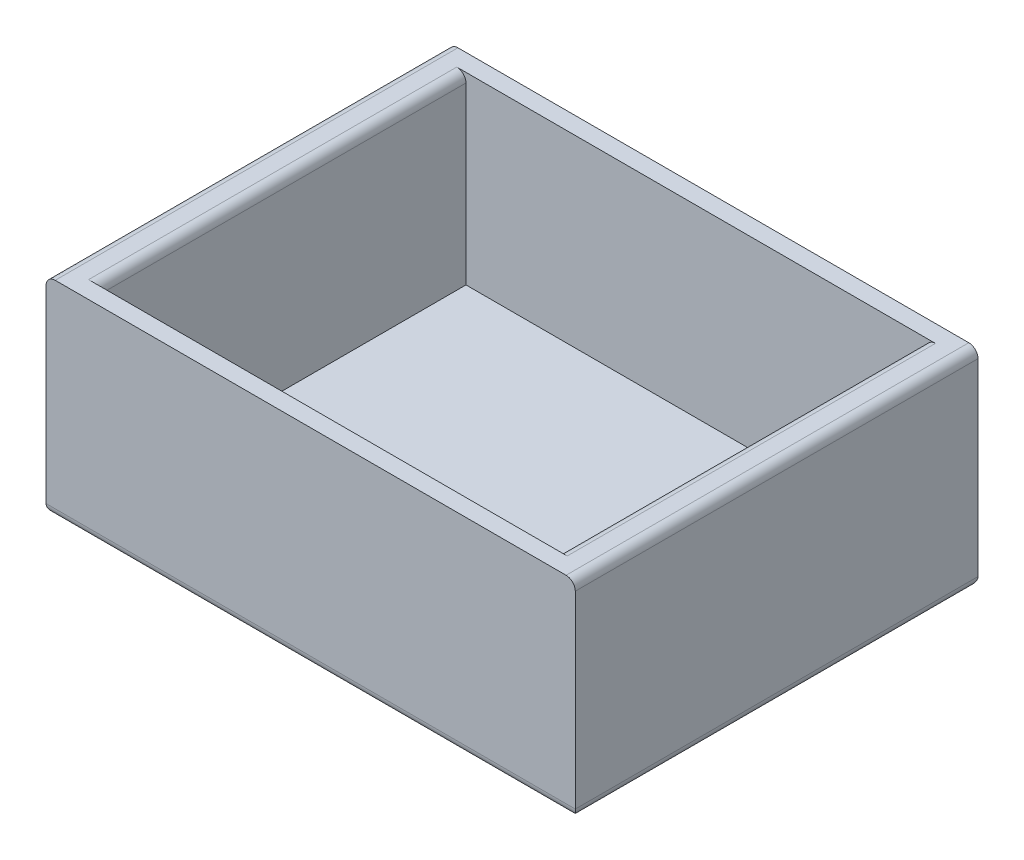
ISO-10303-21;
HEADER;
FILE_DESCRIPTION(('STEP AP214'),'2;1');
FILE_NAME('part.step','',(''),(''),'','','');
FILE_SCHEMA(('AUTOMOTIVE_DESIGN { 1 0 10303 214 1 1 1 1 }'));
ENDSEC;
DATA;
#1=APPLICATION_CONTEXT('core data for automotive mechanical design processes');
#2=APPLICATION_PROTOCOL_DEFINITION('international standard','automotive_design',2000,#1);
#3=PRODUCT_CONTEXT('',#1,'mechanical');
#4=PRODUCT('Part','Part','',(#3));
#5=PRODUCT_RELATED_PRODUCT_CATEGORY('part','',(#4));
#6=PRODUCT_DEFINITION_FORMATION('','',#4);
#7=PRODUCT_DEFINITION_CONTEXT('part definition',#1,'design');
#8=PRODUCT_DEFINITION('design','',#6,#7);
#9=PRODUCT_DEFINITION_SHAPE('','',#8);
#10=(LENGTH_UNIT() NAMED_UNIT(*) SI_UNIT(.MILLI.,.METRE.));
#11=(NAMED_UNIT(*) PLANE_ANGLE_UNIT() SI_UNIT($,.RADIAN.));
#12=(NAMED_UNIT(*) SI_UNIT($,.STERADIAN.) SOLID_ANGLE_UNIT());
#13=UNCERTAINTY_MEASURE_WITH_UNIT(LENGTH_MEASURE(1.E-05),#10,'distance_accuracy_value','');
#14=(GEOMETRIC_REPRESENTATION_CONTEXT(3) GLOBAL_UNCERTAINTY_ASSIGNED_CONTEXT((#13)) GLOBAL_UNIT_ASSIGNED_CONTEXT((#10,
#11,#12)) REPRESENTATION_CONTEXT('',''));
#15=CARTESIAN_POINT('',(0.,0.,0.));
#16=DIRECTION('',(0.,0.,1.));
#17=DIRECTION('',(1.,0.,0.));
#18=AXIS2_PLACEMENT_3D('',#15,#16,#17);
#19=CARTESIAN_POINT('',(73.025,57.15,-55.5625));
#20=DIRECTION('',(-1.,0.,0.));
#21=DIRECTION('',(0.,0.,1.));
#22=AXIS2_PLACEMENT_3D('',#19,#20,#21);
#23=PLANE('',#22);
#24=DIRECTION('',(0.,-1.,0.));
#25=VECTOR('',#24,1.);
#26=CARTESIAN_POINT('',(73.025,57.15,55.5625));
#27=LINE('',#26,#25);
#28=CARTESIAN_POINT('',(73.025,54.61,55.5625));
#29=VERTEX_POINT('',#28);
#30=CARTESIAN_POINT('',(73.025,2.54,55.5625));
#31=VERTEX_POINT('',#30);
#32=EDGE_CURVE('E201',#29,#31,#27,.T.);
#33=ORIENTED_EDGE('',*,*,#32,.T.);
#34=DIRECTION('',(0.,0.,-1.));
#35=VECTOR('',#34,1.);
#36=CARTESIAN_POINT('',(73.025,2.54,-55.5625));
#37=LINE('',#36,#35);
#38=CARTESIAN_POINT('',(73.025,2.54,-55.5625));
#39=VERTEX_POINT('',#38);
#40=EDGE_CURVE('E252',#31,#39,#37,.T.);
#41=ORIENTED_EDGE('',*,*,#40,.T.);
#42=DIRECTION('',(0.,-1.,0.));
#43=VECTOR('',#42,1.);
#44=CARTESIAN_POINT('',(73.025,57.15,-55.5625));
#45=LINE('',#44,#43);
#46=CARTESIAN_POINT('',(73.025,54.61,-55.5625));
#47=VERTEX_POINT('',#46);
#48=EDGE_CURVE('E213',#47,#39,#45,.T.);
#49=ORIENTED_EDGE('',*,*,#48,.F.);
#50=DIRECTION('',(0.,0.,-1.));
#51=VECTOR('',#50,1.);
#52=CARTESIAN_POINT('',(73.025,54.61,55.5625));
#53=LINE('',#52,#51);
#54=EDGE_CURVE('E249',#47,#29,#53,.F.);
#55=ORIENTED_EDGE('',*,*,#54,.T.);
#56=EDGE_LOOP('',(#33,#41,#49,#55));
#57=FACE_BOUND('',#56,.T.);
#58=ADVANCED_FACE('F42',(#57),#23,.F.);
#59=CARTESIAN_POINT('',(-73.025,57.15,-55.5625));
#60=DIRECTION('',(0.,0.,1.));
#61=DIRECTION('',(1.,0.,0.));
#62=AXIS2_PLACEMENT_3D('',#59,#60,#61);
#63=PLANE('',#62);
#64=ORIENTED_EDGE('',*,*,#48,.T.);
#65=DIRECTION('',(-1.,0.,0.));
#66=VECTOR('',#65,1.);
#67=CARTESIAN_POINT('',(-73.025,2.54,-55.5625));
#68=LINE('',#67,#66);
#69=CARTESIAN_POINT('',(-73.025,2.54,-55.5625));
#70=VERTEX_POINT('',#69);
#71=EDGE_CURVE('E223',#39,#70,#68,.T.);
#72=ORIENTED_EDGE('',*,*,#71,.T.);
#73=DIRECTION('',(0.,-1.,0.));
#74=VECTOR('',#73,1.);
#75=CARTESIAN_POINT('',(-73.025,57.15,-55.5625));
#76=LINE('',#75,#74);
#77=CARTESIAN_POINT('',(-73.025,54.61,-55.5625));
#78=VERTEX_POINT('',#77);
#79=EDGE_CURVE('E209',#78,#70,#76,.T.);
#80=ORIENTED_EDGE('',*,*,#79,.F.);
#81=CARTESIAN_POINT('',(-70.485,54.61,-55.5625));
#82=DIRECTION('',(0.,0.,1.));
#83=DIRECTION('',(1.,0.,0.));
#84=AXIS2_PLACEMENT_3D('',#81,#82,#83);
#85=CIRCLE('',#84,2.54);
#86=CARTESIAN_POINT('',(-70.485,57.15,-55.5625));
#87=VERTEX_POINT('',#86);
#88=EDGE_CURVE('E220',#78,#87,#85,.F.);
#89=ORIENTED_EDGE('',*,*,#88,.T.);
#90=DIRECTION('',(-1.,0.,0.));
#91=VECTOR('',#90,1.);
#92=CARTESIAN_POINT('',(-73.025,57.15,-55.5625));
#93=LINE('',#92,#91);
#94=CARTESIAN_POINT('',(70.485,57.15,-55.5625));
#95=VERTEX_POINT('',#94);
#96=EDGE_CURVE('E187',#95,#87,#93,.T.);
#97=ORIENTED_EDGE('',*,*,#96,.F.);
#98=CARTESIAN_POINT('',(70.485,54.61,-55.5625));
#99=DIRECTION('',(0.,0.,1.));
#100=DIRECTION('',(1.,0.,0.));
#101=AXIS2_PLACEMENT_3D('',#98,#99,#100);
#102=CIRCLE('',#101,2.54);
#103=EDGE_CURVE('E217',#95,#47,#102,.F.);
#104=ORIENTED_EDGE('',*,*,#103,.T.);
#105=EDGE_LOOP('',(#64,#72,#80,#89,#97,#104));
#106=FACE_BOUND('',#105,.T.);
#107=ADVANCED_FACE('F326',(#106),#63,.F.);
#108=CARTESIAN_POINT('',(-73.025,57.15,-55.5625));
#109=DIRECTION('',(1.,0.,0.));
#110=DIRECTION('',(0.,0.,-1.));
#111=AXIS2_PLACEMENT_3D('',#108,#109,#110);
#112=PLANE('',#111);
#113=ORIENTED_EDGE('',*,*,#79,.T.);
#114=DIRECTION('',(0.,0.,1.));
#115=VECTOR('',#114,1.);
#116=CARTESIAN_POINT('',(-73.025,2.54,-55.5625));
#117=LINE('',#116,#115);
#118=CARTESIAN_POINT('',(-73.025,2.54,55.5625));
#119=VERTEX_POINT('',#118);
#120=EDGE_CURVE('E258',#70,#119,#117,.T.);
#121=ORIENTED_EDGE('',*,*,#120,.T.);
#122=DIRECTION('',(0.,-1.,0.));
#123=VECTOR('',#122,1.);
#124=CARTESIAN_POINT('',(-73.025,57.15,55.5625));
#125=LINE('',#124,#123);
#126=CARTESIAN_POINT('',(-73.025,54.61,55.5625));
#127=VERTEX_POINT('',#126);
#128=EDGE_CURVE('E205',#127,#119,#125,.T.);
#129=ORIENTED_EDGE('',*,*,#128,.F.);
#130=DIRECTION('',(0.,0.,1.));
#131=VECTOR('',#130,1.);
#132=CARTESIAN_POINT('',(-73.025,54.61,-55.5625));
#133=LINE('',#132,#131);
#134=EDGE_CURVE('E255',#127,#78,#133,.F.);
#135=ORIENTED_EDGE('',*,*,#134,.T.);
#136=EDGE_LOOP('',(#113,#121,#129,#135));
#137=FACE_BOUND('',#136,.T.);
#138=ADVANCED_FACE('F329',(#137),#112,.F.);
#139=CARTESIAN_POINT('',(-73.025,57.15,55.5625));
#140=DIRECTION('',(0.,0.,-1.));
#141=DIRECTION('',(-1.,0.,0.));
#142=AXIS2_PLACEMENT_3D('',#139,#140,#141);
#143=PLANE('',#142);
#144=ORIENTED_EDGE('',*,*,#128,.T.);
#145=DIRECTION('',(1.,0.,0.));
#146=VECTOR('',#145,1.);
#147=CARTESIAN_POINT('',(-73.025,2.54,55.5625));
#148=LINE('',#147,#146);
#149=EDGE_CURVE('E246',#119,#31,#148,.T.);
#150=ORIENTED_EDGE('',*,*,#149,.T.);
#151=ORIENTED_EDGE('',*,*,#32,.F.);
#152=CARTESIAN_POINT('',(70.485,54.61,55.5625));
#153=DIRECTION('',(0.,0.,-1.));
#154=DIRECTION('',(-1.,0.,0.));
#155=AXIS2_PLACEMENT_3D('',#152,#153,#154);
#156=CIRCLE('',#155,2.54);
#157=CARTESIAN_POINT('',(70.485,57.15,55.5625));
#158=VERTEX_POINT('',#157);
#159=EDGE_CURVE('E240',#29,#158,#156,.F.);
#160=ORIENTED_EDGE('',*,*,#159,.T.);
#161=DIRECTION('',(1.,0.,0.));
#162=VECTOR('',#161,1.);
#163=CARTESIAN_POINT('',(-73.025,57.15,55.5625));
#164=LINE('',#163,#162);
#165=CARTESIAN_POINT('',(-70.485,57.15,55.5625));
#166=VERTEX_POINT('',#165);
#167=EDGE_CURVE('E197',#166,#158,#164,.T.);
#168=ORIENTED_EDGE('',*,*,#167,.F.);
#169=CARTESIAN_POINT('',(-70.485,54.61,55.5625));
#170=DIRECTION('',(0.,0.,-1.));
#171=DIRECTION('',(-1.,0.,0.));
#172=AXIS2_PLACEMENT_3D('',#169,#170,#171);
#173=CIRCLE('',#172,2.54);
#174=EDGE_CURVE('E243',#166,#127,#173,.F.);
#175=ORIENTED_EDGE('',*,*,#174,.T.);
#176=EDGE_LOOP('',(#144,#150,#151,#160,#168,#175));
#177=FACE_BOUND('',#176,.T.);
#178=ADVANCED_FACE('F346',(#177),#143,.F.);
#179=CARTESIAN_POINT('',(0.,57.15,0.));
#180=DIRECTION('',(0.,1.,0.));
#181=DIRECTION('',(0.,0.,1.));
#182=AXIS2_PLACEMENT_3D('',#179,#180,#181);
#183=PLANE('',#182);
#184=DIRECTION('',(-1.,0.,0.));
#185=VECTOR('',#184,1.);
#186=CARTESIAN_POINT('',(-63.5,57.15,-50.8));
#187=LINE('',#186,#185);
#188=CARTESIAN_POINT('',(66.04,57.15,-50.8));
#189=VERTEX_POINT('',#188);
#190=CARTESIAN_POINT('',(-66.04,57.15,-50.8));
#191=VERTEX_POINT('',#190);
#192=EDGE_CURVE('E175',#189,#191,#187,.T.);
#193=ORIENTED_EDGE('',*,*,#192,.F.);
#194=DIRECTION('',(0.,0.,-1.));
#195=VECTOR('',#194,1.);
#196=CARTESIAN_POINT('',(66.04,57.15,50.8));
#197=LINE('',#196,#195);
#198=CARTESIAN_POINT('',(66.04,57.15,50.8));
#199=VERTEX_POINT('',#198);
#200=EDGE_CURVE('E265',#189,#199,#197,.F.);
#201=ORIENTED_EDGE('',*,*,#200,.T.);
#202=DIRECTION('',(1.,0.,0.));
#203=VECTOR('',#202,1.);
#204=CARTESIAN_POINT('',(-63.5,57.15,50.8));
#205=LINE('',#204,#203);
#206=CARTESIAN_POINT('',(-66.04,57.15,50.8));
#207=VERTEX_POINT('',#206);
#208=EDGE_CURVE('E172',#207,#199,#205,.T.);
#209=ORIENTED_EDGE('',*,*,#208,.F.);
#210=DIRECTION('',(0.,0.,1.));
#211=VECTOR('',#210,1.);
#212=CARTESIAN_POINT('',(-66.04,57.15,-50.8));
#213=LINE('',#212,#211);
#214=EDGE_CURVE('E261',#207,#191,#213,.F.);
#215=ORIENTED_EDGE('',*,*,#214,.T.);
#216=EDGE_LOOP('',(#193,#201,#209,#215));
#217=FACE_BOUND('',#216,.T.);
#218=ORIENTED_EDGE('',*,*,#96,.T.);
#219=DIRECTION('',(0.,0.,1.));
#220=VECTOR('',#219,1.);
#221=CARTESIAN_POINT('',(-70.485,57.15,55.5625));
#222=LINE('',#221,#220);
#223=EDGE_CURVE('E273',#87,#166,#222,.T.);
#224=ORIENTED_EDGE('',*,*,#223,.T.);
#225=ORIENTED_EDGE('',*,*,#167,.T.);
#226=DIRECTION('',(0.,0.,-1.));
#227=VECTOR('',#226,1.);
#228=CARTESIAN_POINT('',(70.485,57.15,-55.5625));
#229=LINE('',#228,#227);
#230=EDGE_CURVE('E269',#158,#95,#229,.T.);
#231=ORIENTED_EDGE('',*,*,#230,.T.);
#232=EDGE_LOOP('',(#218,#224,#225,#231));
#233=FACE_BOUND('',#232,.T.);
#234=ADVANCED_FACE('F336',(#217,#233),#183,.T.);
#235=CARTESIAN_POINT('',(0.,0.,0.));
#236=DIRECTION('',(0.,1.,0.));
#237=DIRECTION('',(0.,0.,1.));
#238=AXIS2_PLACEMENT_3D('',#235,#236,#237);
#239=PLANE('',#238);
#240=DIRECTION('',(-1.,0.,0.));
#241=VECTOR('',#240,1.);
#242=CARTESIAN_POINT('',(0.,0.,-53.0225));
#243=LINE('',#242,#241);
#244=CARTESIAN_POINT('',(-70.485,0.,-53.0225));
#245=VERTEX_POINT('',#244);
#246=CARTESIAN_POINT('',(70.485,0.,-53.0225));
#247=VERTEX_POINT('',#246);
#248=EDGE_CURVE('E233',#245,#247,#243,.F.);
#249=ORIENTED_EDGE('',*,*,#248,.T.);
#250=DIRECTION('',(0.,0.,-1.));
#251=VECTOR('',#250,1.);
#252=CARTESIAN_POINT('',(70.485,0.,0.));
#253=LINE('',#252,#251);
#254=CARTESIAN_POINT('',(70.485,0.,53.0225));
#255=VERTEX_POINT('',#254);
#256=EDGE_CURVE('E237',#247,#255,#253,.F.);
#257=ORIENTED_EDGE('',*,*,#256,.T.);
#258=DIRECTION('',(1.,0.,0.));
#259=VECTOR('',#258,1.);
#260=CARTESIAN_POINT('',(0.,0.,53.0225));
#261=LINE('',#260,#259);
#262=CARTESIAN_POINT('',(-70.485,0.,53.0225));
#263=VERTEX_POINT('',#262);
#264=EDGE_CURVE('E230',#255,#263,#261,.F.);
#265=ORIENTED_EDGE('',*,*,#264,.T.);
#266=DIRECTION('',(0.,0.,1.));
#267=VECTOR('',#266,1.);
#268=CARTESIAN_POINT('',(-70.485,0.,0.));
#269=LINE('',#268,#267);
#270=EDGE_CURVE('E227',#263,#245,#269,.F.);
#271=ORIENTED_EDGE('',*,*,#270,.T.);
#272=EDGE_LOOP('',(#249,#257,#265,#271));
#273=FACE_BOUND('',#272,.T.);
#274=ADVANCED_FACE('F315',(#273),#239,.F.);
#275=CARTESIAN_POINT('',(63.5,6.35,-50.8));
#276=DIRECTION('',(1.,0.,0.));
#277=DIRECTION('',(0.,0.,-1.));
#278=AXIS2_PLACEMENT_3D('',#275,#276,#277);
#279=PLANE('',#278);
#280=DIRECTION('',(0.,1.,0.));
#281=VECTOR('',#280,1.);
#282=CARTESIAN_POINT('',(63.5,6.35,50.8));
#283=LINE('',#282,#281);
#284=CARTESIAN_POINT('',(63.5,6.35,50.8));
#285=VERTEX_POINT('',#284);
#286=CARTESIAN_POINT('',(63.5,54.61,50.8));
#287=VERTEX_POINT('',#286);
#288=EDGE_CURVE('E184',#285,#287,#283,.T.);
#289=ORIENTED_EDGE('',*,*,#288,.T.);
#290=DIRECTION('',(0.,0.,-1.));
#291=VECTOR('',#290,1.);
#292=CARTESIAN_POINT('',(63.5,54.61,-50.8));
#293=LINE('',#292,#291);
#294=CARTESIAN_POINT('',(63.5,54.61,-50.8));
#295=VERTEX_POINT('',#294);
#296=EDGE_CURVE('E154',#287,#295,#293,.T.);
#297=ORIENTED_EDGE('',*,*,#296,.T.);
#298=DIRECTION('',(0.,1.,0.));
#299=VECTOR('',#298,1.);
#300=CARTESIAN_POINT('',(63.5,6.35,-50.8));
#301=LINE('',#300,#299);
#302=CARTESIAN_POINT('',(63.5,6.35,-50.8));
#303=VERTEX_POINT('',#302);
#304=EDGE_CURVE('E146',#303,#295,#301,.T.);
#305=ORIENTED_EDGE('',*,*,#304,.F.);
#306=DIRECTION('',(0.,0.,-1.));
#307=VECTOR('',#306,1.);
#308=CARTESIAN_POINT('',(63.5,6.35,-50.8));
#309=LINE('',#308,#307);
#310=EDGE_CURVE('E151',#285,#303,#309,.T.);
#311=ORIENTED_EDGE('',*,*,#310,.F.);
#312=EDGE_LOOP('',(#289,#297,#305,#311));
#313=FACE_BOUND('',#312,.T.);
#314=ADVANCED_FACE('F149',(#313),#279,.F.);
#315=CARTESIAN_POINT('',(-63.5,6.35,50.8));
#316=DIRECTION('',(0.,0.,1.));
#317=DIRECTION('',(1.,0.,0.));
#318=AXIS2_PLACEMENT_3D('',#315,#316,#317);
#319=PLANE('',#318);
#320=ORIENTED_EDGE('',*,*,#208,.T.);
#321=CARTESIAN_POINT('',(66.04,54.61,50.8));
#322=DIRECTION('',(0.,0.,1.));
#323=DIRECTION('',(1.,0.,0.));
#324=AXIS2_PLACEMENT_3D('',#321,#322,#323);
#325=CIRCLE('',#324,2.54);
#326=EDGE_CURVE('E285',#199,#287,#325,.T.);
#327=ORIENTED_EDGE('',*,*,#326,.T.);
#328=ORIENTED_EDGE('',*,*,#288,.F.);
#329=DIRECTION('',(1.,0.,0.));
#330=VECTOR('',#329,1.);
#331=CARTESIAN_POINT('',(-63.5,6.35,50.8));
#332=LINE('',#331,#330);
#333=CARTESIAN_POINT('',(-63.5,6.35,50.8));
#334=VERTEX_POINT('',#333);
#335=EDGE_CURVE('E158',#334,#285,#332,.T.);
#336=ORIENTED_EDGE('',*,*,#335,.F.);
#337=DIRECTION('',(0.,1.,0.));
#338=VECTOR('',#337,1.);
#339=CARTESIAN_POINT('',(-63.5,6.35,50.8));
#340=LINE('',#339,#338);
#341=CARTESIAN_POINT('',(-63.5,54.61,50.8));
#342=VERTEX_POINT('',#341);
#343=EDGE_CURVE('E188',#334,#342,#340,.T.);
#344=ORIENTED_EDGE('',*,*,#343,.T.);
#345=CARTESIAN_POINT('',(-66.04,54.61,50.8));
#346=DIRECTION('',(0.,0.,1.));
#347=DIRECTION('',(1.,0.,0.));
#348=AXIS2_PLACEMENT_3D('',#345,#346,#347);
#349=CIRCLE('',#348,2.54);
#350=EDGE_CURVE('E52',#342,#207,#349,.T.);
#351=ORIENTED_EDGE('',*,*,#350,.T.);
#352=EDGE_LOOP('',(#320,#327,#328,#336,#344,#351));
#353=FACE_BOUND('',#352,.T.);
#354=ADVANCED_FACE('F384',(#353),#319,.F.);
#355=CARTESIAN_POINT('',(-63.5,6.35,-50.8));
#356=DIRECTION('',(-1.,0.,0.));
#357=DIRECTION('',(0.,0.,1.));
#358=AXIS2_PLACEMENT_3D('',#355,#356,#357);
#359=PLANE('',#358);
#360=DIRECTION('',(0.,1.,0.));
#361=VECTOR('',#360,1.);
#362=CARTESIAN_POINT('',(-63.5,6.35,-50.8));
#363=LINE('',#362,#361);
#364=CARTESIAN_POINT('',(-63.5,6.35,-50.8));
#365=VERTEX_POINT('',#364);
#366=CARTESIAN_POINT('',(-63.5,54.61,-50.8));
#367=VERTEX_POINT('',#366);
#368=EDGE_CURVE('E157',#365,#367,#363,.T.);
#369=ORIENTED_EDGE('',*,*,#368,.T.);
#370=DIRECTION('',(0.,0.,1.));
#371=VECTOR('',#370,1.);
#372=CARTESIAN_POINT('',(-63.5,54.61,50.8));
#373=LINE('',#372,#371);
#374=EDGE_CURVE('E279',#367,#342,#373,.T.);
#375=ORIENTED_EDGE('',*,*,#374,.T.);
#376=ORIENTED_EDGE('',*,*,#343,.F.);
#377=DIRECTION('',(0.,0.,1.));
#378=VECTOR('',#377,1.);
#379=CARTESIAN_POINT('',(-63.5,6.35,-50.8));
#380=LINE('',#379,#378);
#381=EDGE_CURVE('E167',#365,#334,#380,.T.);
#382=ORIENTED_EDGE('',*,*,#381,.F.);
#383=EDGE_LOOP('',(#369,#375,#376,#382));
#384=FACE_BOUND('',#383,.T.);
#385=ADVANCED_FACE('F386',(#384),#359,.F.);
#386=CARTESIAN_POINT('',(-63.5,6.35,-50.8));
#387=DIRECTION('',(0.,0.,-1.));
#388=DIRECTION('',(-1.,0.,0.));
#389=AXIS2_PLACEMENT_3D('',#386,#387,#388);
#390=PLANE('',#389);
#391=ORIENTED_EDGE('',*,*,#192,.T.);
#392=CARTESIAN_POINT('',(-66.04,54.61,-50.8));
#393=DIRECTION('',(0.,0.,-1.));
#394=DIRECTION('',(-1.,0.,0.));
#395=AXIS2_PLACEMENT_3D('',#392,#393,#394);
#396=CIRCLE('',#395,2.54);
#397=EDGE_CURVE('E11',#191,#367,#396,.T.);
#398=ORIENTED_EDGE('',*,*,#397,.T.);
#399=ORIENTED_EDGE('',*,*,#368,.F.);
#400=DIRECTION('',(-1.,0.,0.));
#401=VECTOR('',#400,1.);
#402=CARTESIAN_POINT('',(-63.5,6.35,-50.8));
#403=LINE('',#402,#401);
#404=EDGE_CURVE('E161',#303,#365,#403,.T.);
#405=ORIENTED_EDGE('',*,*,#404,.F.);
#406=ORIENTED_EDGE('',*,*,#304,.T.);
#407=CARTESIAN_POINT('',(66.04,54.61,-50.8));
#408=DIRECTION('',(0.,0.,-1.));
#409=DIRECTION('',(-1.,0.,0.));
#410=AXIS2_PLACEMENT_3D('',#407,#408,#409);
#411=CIRCLE('',#410,2.54);
#412=EDGE_CURVE('E282',#295,#189,#411,.T.);
#413=ORIENTED_EDGE('',*,*,#412,.T.);
#414=EDGE_LOOP('',(#391,#398,#399,#405,#406,#413));
#415=FACE_BOUND('',#414,.T.);
#416=ADVANCED_FACE('F162',(#415),#390,.F.);
#417=CARTESIAN_POINT('',(0.,6.35,0.));
#418=DIRECTION('',(0.,1.,0.));
#419=DIRECTION('',(0.,0.,1.));
#420=AXIS2_PLACEMENT_3D('',#417,#418,#419);
#421=PLANE('',#420);
#422=ORIENTED_EDGE('',*,*,#310,.T.);
#423=ORIENTED_EDGE('',*,*,#404,.T.);
#424=ORIENTED_EDGE('',*,*,#381,.T.);
#425=ORIENTED_EDGE('',*,*,#335,.T.);
#426=EDGE_LOOP('',(#422,#423,#424,#425));
#427=FACE_BOUND('',#426,.T.);
#428=ADVANCED_FACE('F169',(#427),#421,.T.);
#429=CARTESIAN_POINT('',(-73.025,2.54,53.0225));
#430=DIRECTION('',(1.,0.,0.));
#431=DIRECTION('',(0.,0.,-1.));
#432=AXIS2_PLACEMENT_3D('',#429,#430,#431);
#433=CYLINDRICAL_SURFACE('',#432,2.54);
#434=CARTESIAN_POINT('',(-70.485,2.54,53.0225));
#435=DIRECTION('',(0.707106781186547,0.,0.707106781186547));
#436=DIRECTION('',(-0.707106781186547,0.,0.707106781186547));
#437=AXIS2_PLACEMENT_3D('',#434,#435,#436);
#438=ELLIPSE('',#437,3.59210244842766,2.54);
#439=EDGE_CURVE('E295',#263,#119,#438,.F.);
#440=ORIENTED_EDGE('',*,*,#439,.F.);
#441=ORIENTED_EDGE('',*,*,#264,.F.);
#442=CARTESIAN_POINT('',(70.485,2.54,53.0225));
#443=DIRECTION('',(0.707106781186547,0.,-0.707106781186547));
#444=DIRECTION('',(-0.707106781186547,0.,-0.707106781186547));
#445=AXIS2_PLACEMENT_3D('',#442,#443,#444);
#446=ELLIPSE('',#445,3.59210244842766,2.54);
#447=EDGE_CURVE('E46',#31,#255,#446,.T.);
#448=ORIENTED_EDGE('',*,*,#447,.F.);
#449=ORIENTED_EDGE('',*,*,#149,.F.);
#450=EDGE_LOOP('',(#440,#441,#448,#449));
#451=FACE_BOUND('',#450,.T.);
#452=ADVANCED_FACE('F313',(#451),#433,.T.);
#453=CARTESIAN_POINT('',(70.485,2.54,-55.5625));
#454=DIRECTION('',(0.,0.,-1.));
#455=DIRECTION('',(-1.,0.,0.));
#456=AXIS2_PLACEMENT_3D('',#453,#454,#455);
#457=CYLINDRICAL_SURFACE('',#456,2.54);
#458=ORIENTED_EDGE('',*,*,#447,.T.);
#459=ORIENTED_EDGE('',*,*,#256,.F.);
#460=CARTESIAN_POINT('',(70.485,2.54,-53.0225));
#461=DIRECTION('',(-0.707106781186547,0.,-0.707106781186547));
#462=DIRECTION('',(0.707106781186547,0.,-0.707106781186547));
#463=AXIS2_PLACEMENT_3D('',#460,#461,#462);
#464=ELLIPSE('',#463,3.59210244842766,2.54);
#465=EDGE_CURVE('E293',#39,#247,#464,.T.);
#466=ORIENTED_EDGE('',*,*,#465,.F.);
#467=ORIENTED_EDGE('',*,*,#40,.F.);
#468=EDGE_LOOP('',(#458,#459,#466,#467));
#469=FACE_BOUND('',#468,.T.);
#470=ADVANCED_FACE('F308',(#469),#457,.T.);
#471=CARTESIAN_POINT('',(-70.485,2.54,-55.5625));
#472=DIRECTION('',(0.,0.,1.));
#473=DIRECTION('',(1.,0.,0.));
#474=AXIS2_PLACEMENT_3D('',#471,#472,#473);
#475=CYLINDRICAL_SURFACE('',#474,2.54);
#476=ORIENTED_EDGE('',*,*,#439,.T.);
#477=ORIENTED_EDGE('',*,*,#120,.F.);
#478=CARTESIAN_POINT('',(-70.485,2.54,-53.0225));
#479=DIRECTION('',(-0.707106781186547,0.,0.707106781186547));
#480=DIRECTION('',(0.707106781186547,0.,0.707106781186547));
#481=AXIS2_PLACEMENT_3D('',#478,#479,#480);
#482=ELLIPSE('',#481,3.59210244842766,2.54);
#483=EDGE_CURVE('E290',#245,#70,#482,.F.);
#484=ORIENTED_EDGE('',*,*,#483,.F.);
#485=ORIENTED_EDGE('',*,*,#270,.F.);
#486=EDGE_LOOP('',(#476,#477,#484,#485));
#487=FACE_BOUND('',#486,.T.);
#488=ADVANCED_FACE('F321',(#487),#475,.T.);
#489=CARTESIAN_POINT('',(-73.025,2.54,-53.0225));
#490=DIRECTION('',(-1.,0.,0.));
#491=DIRECTION('',(0.,0.,1.));
#492=AXIS2_PLACEMENT_3D('',#489,#490,#491);
#493=CYLINDRICAL_SURFACE('',#492,2.54);
#494=ORIENTED_EDGE('',*,*,#465,.T.);
#495=ORIENTED_EDGE('',*,*,#248,.F.);
#496=ORIENTED_EDGE('',*,*,#483,.T.);
#497=ORIENTED_EDGE('',*,*,#71,.F.);
#498=EDGE_LOOP('',(#494,#495,#496,#497));
#499=FACE_BOUND('',#498,.T.);
#500=ADVANCED_FACE('F319',(#499),#493,.T.);
#501=CARTESIAN_POINT('',(-70.485,54.61,0.));
#502=DIRECTION('',(0.,0.,-1.));
#503=DIRECTION('',(-1.,0.,0.));
#504=AXIS2_PLACEMENT_3D('',#501,#502,#503);
#505=CYLINDRICAL_SURFACE('',#504,2.54);
#506=ORIENTED_EDGE('',*,*,#88,.F.);
#507=ORIENTED_EDGE('',*,*,#134,.F.);
#508=ORIENTED_EDGE('',*,*,#174,.F.);
#509=ORIENTED_EDGE('',*,*,#223,.F.);
#510=EDGE_LOOP('',(#506,#507,#508,#509));
#511=FACE_BOUND('',#510,.T.);
#512=ADVANCED_FACE('F332',(#511),#505,.T.);
#513=CARTESIAN_POINT('',(70.485,54.61,0.));
#514=DIRECTION('',(0.,0.,1.));
#515=DIRECTION('',(1.,0.,0.));
#516=AXIS2_PLACEMENT_3D('',#513,#514,#515);
#517=CYLINDRICAL_SURFACE('',#516,2.54);
#518=ORIENTED_EDGE('',*,*,#159,.F.);
#519=ORIENTED_EDGE('',*,*,#54,.F.);
#520=ORIENTED_EDGE('',*,*,#103,.F.);
#521=ORIENTED_EDGE('',*,*,#230,.F.);
#522=EDGE_LOOP('',(#518,#519,#520,#521));
#523=FACE_BOUND('',#522,.T.);
#524=ADVANCED_FACE('F341',(#523),#517,.T.);
#525=CARTESIAN_POINT('',(66.04,54.61,-50.8));
#526=DIRECTION('',(0.,0.,1.));
#527=DIRECTION('',(1.,0.,0.));
#528=AXIS2_PLACEMENT_3D('',#525,#526,#527);
#529=CYLINDRICAL_SURFACE('',#528,2.54);
#530=ORIENTED_EDGE('',*,*,#326,.F.);
#531=ORIENTED_EDGE('',*,*,#200,.F.);
#532=ORIENTED_EDGE('',*,*,#412,.F.);
#533=ORIENTED_EDGE('',*,*,#296,.F.);
#534=EDGE_LOOP('',(#530,#531,#532,#533));
#535=FACE_BOUND('',#534,.T.);
#536=ADVANCED_FACE('F375',(#535),#529,.T.);
#537=CARTESIAN_POINT('',(-66.04,54.61,-50.8));
#538=DIRECTION('',(0.,0.,-1.));
#539=DIRECTION('',(-1.,0.,0.));
#540=AXIS2_PLACEMENT_3D('',#537,#538,#539);
#541=CYLINDRICAL_SURFACE('',#540,2.54);
#542=ORIENTED_EDGE('',*,*,#397,.F.);
#543=ORIENTED_EDGE('',*,*,#214,.F.);
#544=ORIENTED_EDGE('',*,*,#350,.F.);
#545=ORIENTED_EDGE('',*,*,#374,.F.);
#546=EDGE_LOOP('',(#542,#543,#544,#545));
#547=FACE_BOUND('',#546,.T.);
#548=ADVANCED_FACE('F44',(#547),#541,.T.);
#549=CLOSED_SHELL('',(#58,#107,#138,#178,#234,#274,#314,#354,#385,#416,#428,#452,#470,#488,#500,
#512,#524,#536,#548));
#550=MANIFOLD_SOLID_BREP('B2',#549);
#551=ADVANCED_BREP_SHAPE_REPRESENTATION('',(#18,#550),#14);
#552=SHAPE_DEFINITION_REPRESENTATION(#9,#551);
ENDSEC;
END-ISO-10303-21;
